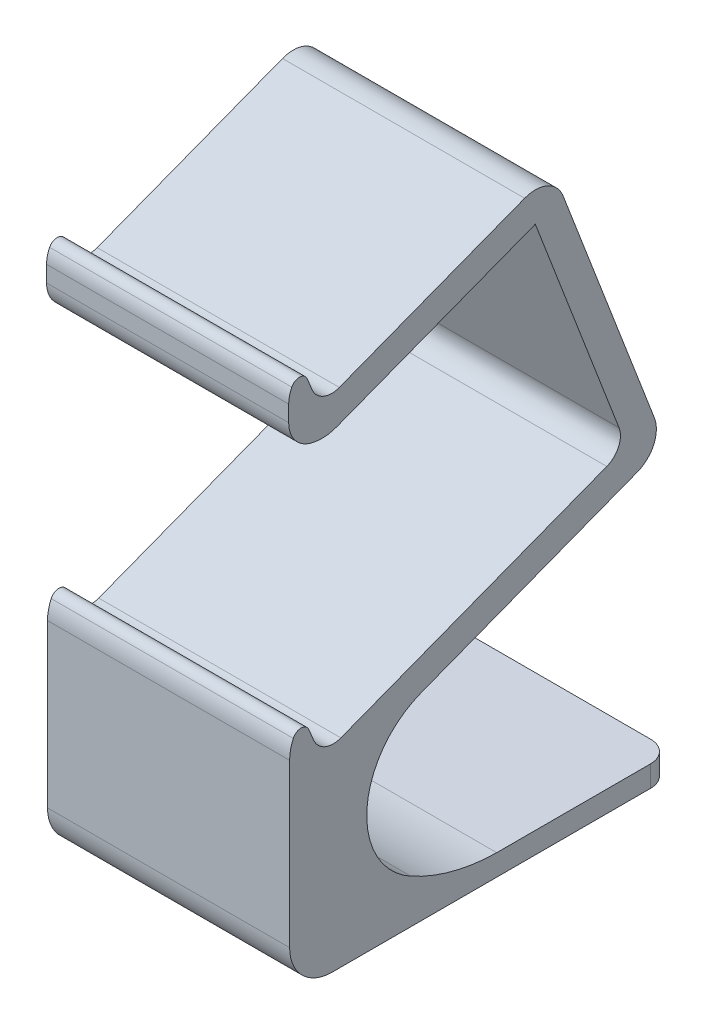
ISO-10303-21;
HEADER;
FILE_DESCRIPTION(('STEP AP214'),'2;1');
FILE_NAME('part.step','',(''),(''),'','','');
FILE_SCHEMA(('AUTOMOTIVE_DESIGN { 1 0 10303 214 1 1 1 1 }'));
ENDSEC;
DATA;
#1=APPLICATION_CONTEXT('core data for automotive mechanical design processes');
#2=APPLICATION_PROTOCOL_DEFINITION('international standard','automotive_design',2000,#1);
#3=PRODUCT_CONTEXT('',#1,'mechanical');
#4=PRODUCT('Part','Part','',(#3));
#5=PRODUCT_RELATED_PRODUCT_CATEGORY('part','',(#4));
#6=PRODUCT_DEFINITION_FORMATION('','',#4);
#7=PRODUCT_DEFINITION_CONTEXT('part definition',#1,'design');
#8=PRODUCT_DEFINITION('design','',#6,#7);
#9=PRODUCT_DEFINITION_SHAPE('','',#8);
#10=(LENGTH_UNIT() NAMED_UNIT(*) SI_UNIT(.MILLI.,.METRE.));
#11=(NAMED_UNIT(*) PLANE_ANGLE_UNIT() SI_UNIT($,.RADIAN.));
#12=(NAMED_UNIT(*) SI_UNIT($,.STERADIAN.) SOLID_ANGLE_UNIT());
#13=UNCERTAINTY_MEASURE_WITH_UNIT(LENGTH_MEASURE(1.E-05),#10,'distance_accuracy_value','');
#14=(GEOMETRIC_REPRESENTATION_CONTEXT(3) GLOBAL_UNCERTAINTY_ASSIGNED_CONTEXT((#13)) GLOBAL_UNIT_ASSIGNED_CONTEXT((#10,
#11,#12)) REPRESENTATION_CONTEXT('',''));
#15=CARTESIAN_POINT('',(0.,0.,0.));
#16=DIRECTION('',(0.,0.,1.));
#17=DIRECTION('',(1.,0.,0.));
#18=AXIS2_PLACEMENT_3D('',#15,#16,#17);
#19=CARTESIAN_POINT('',(0.,5.,0.));
#20=DIRECTION('',(0.,-1.,0.));
#21=DIRECTION('',(0.,0.,-1.));
#22=AXIS2_PLACEMENT_3D('',#19,#20,#21);
#23=PLANE('',#22);
#24=DIRECTION('',(-1.,0.,0.));
#25=VECTOR('',#24,1.);
#26=CARTESIAN_POINT('',(0.,5.,-90.));
#27=LINE('',#26,#25);
#28=CARTESIAN_POINT('',(52.,5.,-90.));
#29=VERTEX_POINT('',#28);
#30=CARTESIAN_POINT('',(5.,5.,-90.));
#31=VERTEX_POINT('',#30);
#32=EDGE_CURVE('E253',#29,#31,#27,.T.);
#33=ORIENTED_EDGE('',*,*,#32,.T.);
#34=CARTESIAN_POINT('',(5.,5.,-85.));
#35=DIRECTION('',(0.,-1.,0.));
#36=DIRECTION('',(0.,0.,-1.));
#37=AXIS2_PLACEMENT_3D('',#34,#35,#36);
#38=CIRCLE('',#37,5.);
#39=CARTESIAN_POINT('',(0.,5.,-85.));
#40=VERTEX_POINT('',#39);
#41=EDGE_CURVE('E330',#31,#40,#38,.F.);
#42=ORIENTED_EDGE('',*,*,#41,.T.);
#43=DIRECTION('',(0.,0.,1.));
#44=VECTOR('',#43,1.);
#45=CARTESIAN_POINT('',(0.,5.,0.));
#46=LINE('',#45,#44);
#47=CARTESIAN_POINT('',(0.,5.,-48.75));
#48=VERTEX_POINT('',#47);
#49=EDGE_CURVE('E245',#40,#48,#46,.T.);
#50=ORIENTED_EDGE('',*,*,#49,.T.);
#51=DIRECTION('',(1.,0.,0.));
#52=VECTOR('',#51,1.);
#53=CARTESIAN_POINT('',(57.,5.,-48.75));
#54=LINE('',#53,#52);
#55=CARTESIAN_POINT('',(57.,5.,-48.75));
#56=VERTEX_POINT('',#55);
#57=EDGE_CURVE('E231',#48,#56,#54,.T.);
#58=ORIENTED_EDGE('',*,*,#57,.T.);
#59=DIRECTION('',(0.,0.,-1.));
#60=VECTOR('',#59,1.);
#61=CARTESIAN_POINT('',(57.,5.,0.));
#62=LINE('',#61,#60);
#63=CARTESIAN_POINT('',(57.,5.,-85.));
#64=VERTEX_POINT('',#63);
#65=EDGE_CURVE('E242',#56,#64,#62,.T.);
#66=ORIENTED_EDGE('',*,*,#65,.T.);
#67=CARTESIAN_POINT('',(52.,5.,-85.));
#68=DIRECTION('',(0.,-1.,0.));
#69=DIRECTION('',(0.,0.,-1.));
#70=AXIS2_PLACEMENT_3D('',#67,#68,#69);
#71=CIRCLE('',#70,5.);
#72=EDGE_CURVE('E328',#64,#29,#71,.F.);
#73=ORIENTED_EDGE('',*,*,#72,.T.);
#74=EDGE_LOOP('',(#33,#42,#50,#58,#66,#73));
#75=FACE_BOUND('',#74,.T.);
#76=ADVANCED_FACE('F37',(#75),#23,.F.);
#77=CARTESIAN_POINT('',(0.,5.,0.));
#78=DIRECTION('',(1.,0.,0.));
#79=DIRECTION('',(0.,0.,-1.));
#80=AXIS2_PLACEMENT_3D('',#77,#78,#79);
#81=PLANE('',#80);
#82=CARTESIAN_POINT('',(0.,120.938108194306,-6.77645214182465));
#83=DIRECTION('',(1.,0.,0.));
#84=DIRECTION('',(0.,0.,-1.));
#85=AXIS2_PLACEMENT_3D('',#82,#83,#84);
#86=CIRCLE('',#85,7.);
#87=CARTESIAN_POINT('',(0.,120.938108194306,0.223547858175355));
#88=VERTEX_POINT('',#87);
#89=CARTESIAN_POINT('',(0.,124.03637918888,-0.499453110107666));
#90=VERTEX_POINT('',#89);
#91=EDGE_CURVE('E370',#88,#90,#86,.F.);
#92=ORIENTED_EDGE('',*,*,#91,.T.);
#93=CARTESIAN_POINT('',(0.,123.151158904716,-2.29288140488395));
#94=DIRECTION('',(1.,0.,0.));
#95=DIRECTION('',(0.,0.,-1.));
#96=AXIS2_PLACEMENT_3D('',#93,#94,#95);
#97=CIRCLE('',#96,2.);
#98=CARTESIAN_POINT('',(0.,123.910071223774,-4.14330084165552));
#99=VERTEX_POINT('',#98);
#100=EDGE_CURVE('E59',#90,#99,#97,.F.);
#101=ORIENTED_EDGE('',*,*,#100,.T.);
#102=DIRECTION('',(0.,-0.925209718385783,-0.379456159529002));
#103=VECTOR('',#102,1.);
#104=CARTESIAN_POINT('',(0.,126.803907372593,-2.95645214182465));
#105=LINE('',#104,#103);
#106=CARTESIAN_POINT('',(0.,121.14907619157,-5.27566742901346));
#107=VERTEX_POINT('',#106);
#108=EDGE_CURVE('E390',#99,#107,#105,.T.);
#109=ORIENTED_EDGE('',*,*,#108,.T.);
#110=CARTESIAN_POINT('',(0.,123.046356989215,-9.90171602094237));
#111=DIRECTION('',(1.,0.,0.));
#112=DIRECTION('',(0.,0.,-1.));
#113=AXIS2_PLACEMENT_3D('',#110,#111,#112);
#114=CIRCLE('',#113,5.);
#115=CARTESIAN_POINT('',(0.,118.378454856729,-11.6935557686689));
#116=VERTEX_POINT('',#115);
#117=EDGE_CURVE('E347',#107,#116,#114,.T.);
#118=ORIENTED_EDGE('',*,*,#117,.T.);
#119=DIRECTION('',(0.,0.358367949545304,-0.933580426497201));
#120=VECTOR('',#119,1.);
#121=CARTESIAN_POINT('',(0.,135.126800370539,-55.3244875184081));
#122=LINE('',#121,#120);
#123=CARTESIAN_POINT('',(0.,135.126800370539,-55.3244875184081));
#124=VERTEX_POINT('',#123);
#125=EDGE_CURVE('E407',#116,#124,#122,.T.);
#126=ORIENTED_EDGE('',*,*,#125,.T.);
#127=CARTESIAN_POINT('',(0.,128.590007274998,-57.8337272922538));
#128=DIRECTION('',(1.,0.,0.));
#129=DIRECTION('',(0.,0.,-1.));
#130=AXIS2_PLACEMENT_3D('',#127,#128,#129);
#131=CIRCLE('',#130,7.00185319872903);
#132=CARTESIAN_POINT('',(0.,131.099247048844,-64.370520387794));
#133=VERTEX_POINT('',#132);
#134=EDGE_CURVE('E405',#124,#133,#131,.F.);
#135=ORIENTED_EDGE('',*,*,#134,.T.);
#136=DIRECTION('',(0.,-0.9335804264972,-0.358367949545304));
#137=VECTOR('',#136,1.);
#138=CARTESIAN_POINT('',(0.,75.0844214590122,-85.8725973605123));
#139=LINE('',#138,#137);
#140=CARTESIAN_POINT('',(0.,75.0844214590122,-85.8725973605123));
#141=VERTEX_POINT('',#140);
#142=EDGE_CURVE('E402',#133,#141,#139,.T.);
#143=ORIENTED_EDGE('',*,*,#142,.T.);
#144=CARTESIAN_POINT('',(0.,72.5751816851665,-79.335804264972));
#145=DIRECTION('',(1.,0.,0.));
#146=DIRECTION('',(0.,0.,-1.));
#147=AXIS2_PLACEMENT_3D('',#144,#145,#146);
#148=CIRCLE('',#147,7.00185319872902);
#149=CARTESIAN_POINT('',(0.,66.0383885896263,-81.8450440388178));
#150=VERTEX_POINT('',#149);
#151=EDGE_CURVE('E399',#141,#150,#148,.F.);
#152=ORIENTED_EDGE('',*,*,#151,.T.);
#153=DIRECTION('',(0.,-0.3583679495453,0.933580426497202));
#154=VECTOR('',#153,1.);
#155=CARTESIAN_POINT('',(0.,61.4915021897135,-70.));
#156=LINE('',#155,#154);
#157=CARTESIAN_POINT('',(0.,46.5150375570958,-30.9849757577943));
#158=VERTEX_POINT('',#157);
#159=EDGE_CURVE('E447',#150,#158,#156,.T.);
#160=ORIENTED_EDGE('',*,*,#159,.T.);
#161=CARTESIAN_POINT('',(0.,27.8434290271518,-38.1523347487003));
#162=DIRECTION('',(1.,0.,0.));
#163=DIRECTION('',(0.,0.,-1.));
#164=AXIS2_PLACEMENT_3D('',#161,#162,#163);
#165=CIRCLE('',#164,20.);
#166=CARTESIAN_POINT('',(0.,10.3110967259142,-28.5285452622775));
#167=VERTEX_POINT('',#166);
#168=EDGE_CURVE('E312',#158,#167,#165,.T.);
#169=ORIENTED_EDGE('',*,*,#168,.T.);
#170=CARTESIAN_POINT('',(0.,48.0663494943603,-49.2530329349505));
#171=DIRECTION('',(1.,0.,0.));
#172=DIRECTION('',(0.,0.,-1.));
#173=AXIS2_PLACEMENT_3D('',#170,#171,#172);
#174=CIRCLE('',#173,43.0692872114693);
#175=EDGE_CURVE('E237',#167,#48,#174,.T.);
#176=ORIENTED_EDGE('',*,*,#175,.T.);
#177=ORIENTED_EDGE('',*,*,#49,.F.);
#178=DIRECTION('',(0.,-1.,0.));
#179=VECTOR('',#178,1.);
#180=CARTESIAN_POINT('',(0.,5.,-85.));
#181=LINE('',#180,#179);
#182=CARTESIAN_POINT('',(0.,0.,-85.));
#183=VERTEX_POINT('',#182);
#184=EDGE_CURVE('E316',#40,#183,#181,.T.);
#185=ORIENTED_EDGE('',*,*,#184,.T.);
#186=DIRECTION('',(0.,0.,1.));
#187=VECTOR('',#186,1.);
#188=CARTESIAN_POINT('',(0.,0.,0.));
#189=LINE('',#188,#187);
#190=CARTESIAN_POINT('',(0.,0.,-10.));
#191=VERTEX_POINT('',#190);
#192=EDGE_CURVE('E261',#183,#191,#189,.T.);
#193=ORIENTED_EDGE('',*,*,#192,.T.);
#194=CARTESIAN_POINT('',(0.,10.,-10.));
#195=DIRECTION('',(1.,0.,0.));
#196=DIRECTION('',(0.,0.,-1.));
#197=AXIS2_PLACEMENT_3D('',#194,#195,#196);
#198=CIRCLE('',#197,10.);
#199=CARTESIAN_POINT('',(0.,10.,0.));
#200=VERTEX_POINT('',#199);
#201=EDGE_CURVE('E279',#191,#200,#198,.F.);
#202=ORIENTED_EDGE('',*,*,#201,.T.);
#203=DIRECTION('',(0.,-1.,0.));
#204=VECTOR('',#203,1.);
#205=CARTESIAN_POINT('',(0.,5.,0.));
#206=LINE('',#205,#204);
#207=CARTESIAN_POINT('',(0.,48.1958885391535,0.));
#208=VERTEX_POINT('',#207);
#209=EDGE_CURVE('E269',#208,#200,#206,.T.);
#210=ORIENTED_EDGE('',*,*,#209,.F.);
#211=CARTESIAN_POINT('',(0.,48.1958885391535,-10.));
#212=DIRECTION('',(1.,0.,0.));
#213=DIRECTION('',(0.,0.,-1.));
#214=AXIS2_PLACEMENT_3D('',#211,#212,#213);
#215=CIRCLE('',#214,10.);
#216=CARTESIAN_POINT('',(0.,52.2463152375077,-0.857022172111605));
#217=VERTEX_POINT('',#216);
#218=EDGE_CURVE('E286',#208,#217,#215,.F.);
#219=ORIENTED_EDGE('',*,*,#218,.T.);
#220=CARTESIAN_POINT('',(0.,51.4362298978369,-2.68561773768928));
#221=DIRECTION('',(1.,0.,0.));
#222=DIRECTION('',(0.,0.,-1.));
#223=AXIS2_PLACEMENT_3D('',#220,#221,#222);
#224=CIRCLE('',#223,2.);
#225=CARTESIAN_POINT('',(0.,52.1980052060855,-4.53486038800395));
#226=VERTEX_POINT('',#225);
#227=EDGE_CURVE('E296',#217,#226,#224,.F.);
#228=ORIENTED_EDGE('',*,*,#227,.T.);
#229=DIRECTION('',(0.,-0.924621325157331,-0.380887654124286));
#230=VECTOR('',#229,1.);
#231=CARTESIAN_POINT('',(0.,55.5031831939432,-3.17332842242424));
#232=LINE('',#231,#230);
#233=CARTESIAN_POINT('',(0.,49.5123927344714,-5.64116910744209));
#234=VERTEX_POINT('',#233);
#235=EDGE_CURVE('E442',#226,#234,#232,.T.);
#236=ORIENTED_EDGE('',*,*,#235,.T.);
#237=CARTESIAN_POINT('',(0.,51.4168310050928,-10.2642757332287));
#238=DIRECTION('',(1.,0.,0.));
#239=DIRECTION('',(0.,0.,-1.));
#240=AXIS2_PLACEMENT_3D('',#237,#238,#239);
#241=CIRCLE('',#240,5.);
#242=CARTESIAN_POINT('',(0.,46.7489288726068,-12.0561154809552));
#243=VERTEX_POINT('',#242);
#244=EDGE_CURVE('E303',#234,#243,#241,.T.);
#245=ORIENTED_EDGE('',*,*,#244,.T.);
#246=DIRECTION('',(0.,0.3583679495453,-0.933580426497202));
#247=VECTOR('',#246,1.);
#248=CARTESIAN_POINT('',(0.,45.,-7.5));
#249=LINE('',#248,#247);
#250=CARTESIAN_POINT('',(0.,70.78334193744,-74.667902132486));
#251=VERTEX_POINT('',#250);
#252=EDGE_CURVE('E264',#251,#243,#249,.F.);
#253=ORIENTED_EDGE('',*,*,#252,.F.);
#254=CARTESIAN_POINT('',(0.,75.451244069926,-72.8760623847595));
#255=DIRECTION('',(1.,0.,0.));
#256=DIRECTION('',(0.,0.,-1.));
#257=AXIS2_PLACEMENT_3D('',#254,#255,#256);
#258=CIRCLE('',#257,5.);
#259=CARTESIAN_POINT('',(0.,77.2430838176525,-77.5439645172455));
#260=VERTEX_POINT('',#259);
#261=EDGE_CURVE('E340',#251,#260,#258,.T.);
#262=ORIENTED_EDGE('',*,*,#261,.T.);
#263=DIRECTION('',(0.,0.933580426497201,0.358367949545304));
#264=VECTOR('',#263,1.);
#265=CARTESIAN_POINT('',(0.,128.590007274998,-57.8337272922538));
#266=LINE('',#265,#264);
#267=CARTESIAN_POINT('',(0.,128.590007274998,-57.8337272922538));
#268=VERTEX_POINT('',#267);
#269=EDGE_CURVE('E412',#260,#268,#266,.T.);
#270=ORIENTED_EDGE('',*,*,#269,.T.);
#271=DIRECTION('',(0.,-0.358367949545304,0.933580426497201));
#272=VECTOR('',#271,1.);
#273=CARTESIAN_POINT('',(0.,107.267114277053,-2.2856919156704));
#274=LINE('',#273,#272);
#275=CARTESIAN_POINT('',(0.,110.685935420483,-11.1920254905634));
#276=VERTEX_POINT('',#275);
#277=EDGE_CURVE('E409',#268,#276,#274,.T.);
#278=ORIENTED_EDGE('',*,*,#277,.T.);
#279=CARTESIAN_POINT('',(0.,120.021739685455,-7.60834599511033));
#280=DIRECTION('',(1.,0.,0.));
#281=DIRECTION('',(0.,0.,-1.));
#282=AXIS2_PLACEMENT_3D('',#279,#280,#281);
#283=CIRCLE('',#282,10.);
#284=CARTESIAN_POINT('',(0.,110.413899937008,-4.83536648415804));
#285=VERTEX_POINT('',#284);
#286=EDGE_CURVE('E355',#276,#285,#283,.F.);
#287=ORIENTED_EDGE('',*,*,#286,.T.);
#288=CARTESIAN_POINT('',(0.,117.139387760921,-6.77645214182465));
#289=DIRECTION('',(1.,0.,0.));
#290=DIRECTION('',(0.,0.,-1.));
#291=AXIS2_PLACEMENT_3D('',#288,#289,#290);
#292=CIRCLE('',#291,7.);
#293=CARTESIAN_POINT('',(0.,117.139387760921,0.223547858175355));
#294=VERTEX_POINT('',#293);
#295=EDGE_CURVE('E365',#285,#294,#292,.F.);
#296=ORIENTED_EDGE('',*,*,#295,.T.);
#297=DIRECTION('',(0.,1.,0.));
#298=VECTOR('',#297,1.);
#299=CARTESIAN_POINT('',(0.,113.803907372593,0.223547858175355));
#300=LINE('',#299,#298);
#301=EDGE_CURVE('E247',#294,#88,#300,.T.);
#302=ORIENTED_EDGE('',*,*,#301,.T.);
#303=EDGE_LOOP('',(#92,#101,#109,#118,#126,#135,#143,#152,#160,#169,#176,#177,#185,#193,#202,
#210,#219,#228,#236,#245,#253,#262,#270,#278,#287,#296,#302));
#304=FACE_BOUND('',#303,.T.);
#305=ADVANCED_FACE('F385',(#304),#81,.F.);
#306=CARTESIAN_POINT('',(0.,5.,0.));
#307=DIRECTION('',(0.,0.,-1.));
#308=DIRECTION('',(-1.,0.,0.));
#309=AXIS2_PLACEMENT_3D('',#306,#307,#308);
#310=PLANE('',#309);
#311=DIRECTION('',(0.,-1.,0.));
#312=VECTOR('',#311,1.);
#313=CARTESIAN_POINT('',(57.,5.,0.));
#314=LINE('',#313,#312);
#315=CARTESIAN_POINT('',(57.,48.1958885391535,0.));
#316=VERTEX_POINT('',#315);
#317=CARTESIAN_POINT('',(57.,10.,0.));
#318=VERTEX_POINT('',#317);
#319=EDGE_CURVE('E255',#316,#318,#314,.T.);
#320=ORIENTED_EDGE('',*,*,#319,.F.);
#321=DIRECTION('',(-1.,0.,0.));
#322=VECTOR('',#321,1.);
#323=CARTESIAN_POINT('',(0.,48.1958885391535,0.));
#324=LINE('',#323,#322);
#325=EDGE_CURVE('E284',#316,#208,#324,.T.);
#326=ORIENTED_EDGE('',*,*,#325,.T.);
#327=ORIENTED_EDGE('',*,*,#209,.T.);
#328=DIRECTION('',(1.,0.,0.));
#329=VECTOR('',#328,1.);
#330=CARTESIAN_POINT('',(57.,10.,0.));
#331=LINE('',#330,#329);
#332=EDGE_CURVE('E271',#200,#318,#331,.T.);
#333=ORIENTED_EDGE('',*,*,#332,.T.);
#334=EDGE_LOOP('',(#320,#326,#327,#333));
#335=FACE_BOUND('',#334,.T.);
#336=ADVANCED_FACE('F483',(#335),#310,.F.);
#337=CARTESIAN_POINT('',(57.,5.,0.));
#338=DIRECTION('',(-1.,0.,0.));
#339=DIRECTION('',(0.,0.,1.));
#340=AXIS2_PLACEMENT_3D('',#337,#338,#339);
#341=PLANE('',#340);
#342=DIRECTION('',(0.,0.925209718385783,0.379456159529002));
#343=VECTOR('',#342,1.);
#344=CARTESIAN_POINT('',(57.,126.803907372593,-2.95645214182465));
#345=LINE('',#344,#343);
#346=CARTESIAN_POINT('',(57.,121.14907619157,-5.27566742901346));
#347=VERTEX_POINT('',#346);
#348=CARTESIAN_POINT('',(57.,123.910071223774,-4.14330084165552));
#349=VERTEX_POINT('',#348);
#350=EDGE_CURVE('E392',#347,#349,#345,.T.);
#351=ORIENTED_EDGE('',*,*,#350,.T.);
#352=CARTESIAN_POINT('',(57.,123.151158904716,-2.29288140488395));
#353=DIRECTION('',(-1.,0.,0.));
#354=DIRECTION('',(0.,0.,1.));
#355=AXIS2_PLACEMENT_3D('',#352,#353,#354);
#356=CIRCLE('',#355,2.);
#357=CARTESIAN_POINT('',(57.,124.03637918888,-0.499453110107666));
#358=VERTEX_POINT('',#357);
#359=EDGE_CURVE('E11',#349,#358,#356,.F.);
#360=ORIENTED_EDGE('',*,*,#359,.T.);
#361=CARTESIAN_POINT('',(57.,120.938108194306,-6.77645214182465));
#362=DIRECTION('',(-1.,0.,0.));
#363=DIRECTION('',(0.,0.,1.));
#364=AXIS2_PLACEMENT_3D('',#361,#362,#363);
#365=CIRCLE('',#364,7.);
#366=CARTESIAN_POINT('',(57.,120.938108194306,0.223547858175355));
#367=VERTEX_POINT('',#366);
#368=EDGE_CURVE('E372',#358,#367,#365,.F.);
#369=ORIENTED_EDGE('',*,*,#368,.T.);
#370=DIRECTION('',(0.,-1.,0.));
#371=VECTOR('',#370,1.);
#372=CARTESIAN_POINT('',(57.,113.803907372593,0.223547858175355));
#373=LINE('',#372,#371);
#374=CARTESIAN_POINT('',(57.,117.139387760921,0.223547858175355));
#375=VERTEX_POINT('',#374);
#376=EDGE_CURVE('E396',#367,#375,#373,.T.);
#377=ORIENTED_EDGE('',*,*,#376,.T.);
#378=CARTESIAN_POINT('',(57.,117.139387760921,-6.77645214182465));
#379=DIRECTION('',(-1.,0.,0.));
#380=DIRECTION('',(0.,0.,1.));
#381=AXIS2_PLACEMENT_3D('',#378,#379,#380);
#382=CIRCLE('',#381,7.);
#383=CARTESIAN_POINT('',(57.,110.413899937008,-4.83536648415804));
#384=VERTEX_POINT('',#383);
#385=EDGE_CURVE('E361',#375,#384,#382,.F.);
#386=ORIENTED_EDGE('',*,*,#385,.T.);
#387=CARTESIAN_POINT('',(57.,120.021739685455,-7.60834599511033));
#388=DIRECTION('',(-1.,0.,0.));
#389=DIRECTION('',(0.,0.,1.));
#390=AXIS2_PLACEMENT_3D('',#387,#388,#389);
#391=CIRCLE('',#390,10.);
#392=CARTESIAN_POINT('',(57.,110.685935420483,-11.1920254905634));
#393=VERTEX_POINT('',#392);
#394=EDGE_CURVE('E351',#384,#393,#391,.F.);
#395=ORIENTED_EDGE('',*,*,#394,.T.);
#396=DIRECTION('',(0.,0.358367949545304,-0.9335804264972));
#397=VECTOR('',#396,1.);
#398=CARTESIAN_POINT('',(57.,107.267114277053,-2.2856919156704));
#399=LINE('',#398,#397);
#400=CARTESIAN_POINT('',(57.,128.590007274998,-57.8337272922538));
#401=VERTEX_POINT('',#400);
#402=EDGE_CURVE('E426',#393,#401,#399,.T.);
#403=ORIENTED_EDGE('',*,*,#402,.T.);
#404=DIRECTION('',(0.,-0.9335804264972,-0.358367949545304));
#405=VECTOR('',#404,1.);
#406=CARTESIAN_POINT('',(57.,128.590007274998,-57.8337272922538));
#407=LINE('',#406,#405);
#408=CARTESIAN_POINT('',(57.,77.2430838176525,-77.5439645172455));
#409=VERTEX_POINT('',#408);
#410=EDGE_CURVE('E428',#401,#409,#407,.T.);
#411=ORIENTED_EDGE('',*,*,#410,.T.);
#412=CARTESIAN_POINT('',(57.,75.451244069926,-72.8760623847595));
#413=DIRECTION('',(-1.,0.,0.));
#414=DIRECTION('',(0.,0.,1.));
#415=AXIS2_PLACEMENT_3D('',#412,#413,#414);
#416=CIRCLE('',#415,5.);
#417=CARTESIAN_POINT('',(57.,70.78334193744,-74.667902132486));
#418=VERTEX_POINT('',#417);
#419=EDGE_CURVE('E338',#409,#418,#416,.T.);
#420=ORIENTED_EDGE('',*,*,#419,.T.);
#421=DIRECTION('',(0.,-0.3583679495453,0.933580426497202));
#422=VECTOR('',#421,1.);
#423=CARTESIAN_POINT('',(57.,45.,-7.5));
#424=LINE('',#423,#422);
#425=CARTESIAN_POINT('',(57.,46.7489288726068,-12.0561154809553));
#426=VERTEX_POINT('',#425);
#427=EDGE_CURVE('E450',#426,#418,#424,.F.);
#428=ORIENTED_EDGE('',*,*,#427,.F.);
#429=CARTESIAN_POINT('',(57.,51.4168310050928,-10.2642757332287));
#430=DIRECTION('',(-1.,0.,0.));
#431=DIRECTION('',(0.,0.,1.));
#432=AXIS2_PLACEMENT_3D('',#429,#430,#431);
#433=CIRCLE('',#432,5.);
#434=CARTESIAN_POINT('',(57.,49.5123927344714,-5.64116910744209));
#435=VERTEX_POINT('',#434);
#436=EDGE_CURVE('E306',#426,#435,#433,.T.);
#437=ORIENTED_EDGE('',*,*,#436,.T.);
#438=DIRECTION('',(0.,0.924621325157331,0.380887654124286));
#439=VECTOR('',#438,1.);
#440=CARTESIAN_POINT('',(57.,55.5031831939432,-3.17332842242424));
#441=LINE('',#440,#439);
#442=CARTESIAN_POINT('',(57.,52.1980052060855,-4.53486038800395));
#443=VERTEX_POINT('',#442);
#444=EDGE_CURVE('E414',#435,#443,#441,.T.);
#445=ORIENTED_EDGE('',*,*,#444,.T.);
#446=CARTESIAN_POINT('',(57.,51.4362298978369,-2.68561773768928));
#447=DIRECTION('',(-1.,0.,0.));
#448=DIRECTION('',(0.,0.,1.));
#449=AXIS2_PLACEMENT_3D('',#446,#447,#448);
#450=CIRCLE('',#449,2.);
#451=CARTESIAN_POINT('',(57.,52.2463152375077,-0.857022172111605));
#452=VERTEX_POINT('',#451);
#453=EDGE_CURVE('E292',#443,#452,#450,.F.);
#454=ORIENTED_EDGE('',*,*,#453,.T.);
#455=CARTESIAN_POINT('',(57.,48.1958885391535,-10.));
#456=DIRECTION('',(-1.,0.,0.));
#457=DIRECTION('',(0.,0.,1.));
#458=AXIS2_PLACEMENT_3D('',#455,#456,#457);
#459=CIRCLE('',#458,10.);
#460=EDGE_CURVE('E282',#452,#316,#459,.F.);
#461=ORIENTED_EDGE('',*,*,#460,.T.);
#462=ORIENTED_EDGE('',*,*,#319,.T.);
#463=CARTESIAN_POINT('',(57.,10.,-10.));
#464=DIRECTION('',(-1.,0.,0.));
#465=DIRECTION('',(0.,0.,1.));
#466=AXIS2_PLACEMENT_3D('',#463,#464,#465);
#467=CIRCLE('',#466,10.);
#468=CARTESIAN_POINT('',(57.,0.,-10.));
#469=VERTEX_POINT('',#468);
#470=EDGE_CURVE('E274',#318,#469,#467,.F.);
#471=ORIENTED_EDGE('',*,*,#470,.T.);
#472=DIRECTION('',(0.,0.,-1.));
#473=VECTOR('',#472,1.);
#474=CARTESIAN_POINT('',(57.,0.,0.));
#475=LINE('',#474,#473);
#476=CARTESIAN_POINT('',(57.,0.,-85.));
#477=VERTEX_POINT('',#476);
#478=EDGE_CURVE('E263',#469,#477,#475,.T.);
#479=ORIENTED_EDGE('',*,*,#478,.T.);
#480=DIRECTION('',(0.,-1.,0.));
#481=VECTOR('',#480,1.);
#482=CARTESIAN_POINT('',(57.,5.,-85.));
#483=LINE('',#482,#481);
#484=EDGE_CURVE('E252',#477,#64,#483,.F.);
#485=ORIENTED_EDGE('',*,*,#484,.T.);
#486=ORIENTED_EDGE('',*,*,#65,.F.);
#487=CARTESIAN_POINT('',(57.,48.0663494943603,-49.2530329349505));
#488=DIRECTION('',(1.,0.,0.));
#489=DIRECTION('',(0.,0.,-1.));
#490=AXIS2_PLACEMENT_3D('',#487,#488,#489);
#491=CIRCLE('',#490,43.0692872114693);
#492=CARTESIAN_POINT('',(57.,10.3110967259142,-28.5285452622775));
#493=VERTEX_POINT('',#492);
#494=EDGE_CURVE('E227',#493,#56,#491,.T.);
#495=ORIENTED_EDGE('',*,*,#494,.F.);
#496=CARTESIAN_POINT('',(57.,27.8434290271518,-38.1523347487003));
#497=DIRECTION('',(-1.,0.,0.));
#498=DIRECTION('',(0.,0.,1.));
#499=AXIS2_PLACEMENT_3D('',#496,#497,#498);
#500=CIRCLE('',#499,20.);
#501=CARTESIAN_POINT('',(57.,46.5150375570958,-30.9849757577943));
#502=VERTEX_POINT('',#501);
#503=EDGE_CURVE('E314',#493,#502,#500,.T.);
#504=ORIENTED_EDGE('',*,*,#503,.T.);
#505=DIRECTION('',(0.,-0.3583679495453,0.933580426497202));
#506=VECTOR('',#505,1.);
#507=CARTESIAN_POINT('',(57.,61.4915021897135,-70.));
#508=LINE('',#507,#506);
#509=CARTESIAN_POINT('',(57.,66.0383885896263,-81.8450440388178));
#510=VERTEX_POINT('',#509);
#511=EDGE_CURVE('E445',#510,#502,#508,.T.);
#512=ORIENTED_EDGE('',*,*,#511,.F.);
#513=CARTESIAN_POINT('',(57.,72.5751816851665,-79.335804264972));
#514=DIRECTION('',(1.,0.,0.));
#515=DIRECTION('',(0.,0.,-1.));
#516=AXIS2_PLACEMENT_3D('',#513,#514,#515);
#517=CIRCLE('',#516,7.00185319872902);
#518=CARTESIAN_POINT('',(57.,75.0844214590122,-85.8725973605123));
#519=VERTEX_POINT('',#518);
#520=EDGE_CURVE('E398',#510,#519,#517,.T.);
#521=ORIENTED_EDGE('',*,*,#520,.T.);
#522=DIRECTION('',(0.,0.9335804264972,0.358367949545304));
#523=VECTOR('',#522,1.);
#524=CARTESIAN_POINT('',(57.,75.0844214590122,-85.8725973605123));
#525=LINE('',#524,#523);
#526=CARTESIAN_POINT('',(57.,131.099247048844,-64.370520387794));
#527=VERTEX_POINT('',#526);
#528=EDGE_CURVE('E417',#519,#527,#525,.T.);
#529=ORIENTED_EDGE('',*,*,#528,.T.);
#530=CARTESIAN_POINT('',(57.,128.590007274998,-57.8337272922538));
#531=DIRECTION('',(1.,0.,0.));
#532=DIRECTION('',(0.,0.,-1.));
#533=AXIS2_PLACEMENT_3D('',#530,#531,#532);
#534=CIRCLE('',#533,7.00185319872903);
#535=CARTESIAN_POINT('',(57.,135.126800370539,-55.3244875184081));
#536=VERTEX_POINT('',#535);
#537=EDGE_CURVE('E420',#527,#536,#534,.T.);
#538=ORIENTED_EDGE('',*,*,#537,.T.);
#539=DIRECTION('',(0.,-0.358367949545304,0.9335804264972));
#540=VECTOR('',#539,1.);
#541=CARTESIAN_POINT('',(57.,135.126800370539,-55.3244875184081));
#542=LINE('',#541,#540);
#543=CARTESIAN_POINT('',(57.,118.378454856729,-11.6935557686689));
#544=VERTEX_POINT('',#543);
#545=EDGE_CURVE('E423',#536,#544,#542,.T.);
#546=ORIENTED_EDGE('',*,*,#545,.T.);
#547=CARTESIAN_POINT('',(57.,123.046356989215,-9.90171602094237));
#548=DIRECTION('',(-1.,0.,0.));
#549=DIRECTION('',(0.,0.,1.));
#550=AXIS2_PLACEMENT_3D('',#547,#548,#549);
#551=CIRCLE('',#550,5.);
#552=EDGE_CURVE('E349',#544,#347,#551,.T.);
#553=ORIENTED_EDGE('',*,*,#552,.T.);
#554=EDGE_LOOP('',(#351,#360,#369,#377,#386,#395,#403,#411,#420,#428,#437,#445,#454,#461,#462,
#471,#479,#485,#486,#495,#504,#512,#521,#529,#538,#546,#553));
#555=FACE_BOUND('',#554,.T.);
#556=ADVANCED_FACE('F249',(#555),#341,.F.);
#557=CARTESIAN_POINT('',(0.,5.,-90.));
#558=DIRECTION('',(0.,0.,1.));
#559=DIRECTION('',(1.,0.,0.));
#560=AXIS2_PLACEMENT_3D('',#557,#558,#559);
#561=PLANE('',#560);
#562=DIRECTION('',(-1.,0.,0.));
#563=VECTOR('',#562,1.);
#564=CARTESIAN_POINT('',(0.,0.,-90.));
#565=LINE('',#564,#563);
#566=CARTESIAN_POINT('',(52.,0.,-90.));
#567=VERTEX_POINT('',#566);
#568=CARTESIAN_POINT('',(5.,0.,-90.));
#569=VERTEX_POINT('',#568);
#570=EDGE_CURVE('E257',#567,#569,#565,.T.);
#571=ORIENTED_EDGE('',*,*,#570,.T.);
#572=DIRECTION('',(0.,-1.,0.));
#573=VECTOR('',#572,1.);
#574=CARTESIAN_POINT('',(5.,5.,-90.));
#575=LINE('',#574,#573);
#576=EDGE_CURVE('E326',#569,#31,#575,.F.);
#577=ORIENTED_EDGE('',*,*,#576,.T.);
#578=ORIENTED_EDGE('',*,*,#32,.F.);
#579=DIRECTION('',(0.,-1.,0.));
#580=VECTOR('',#579,1.);
#581=CARTESIAN_POINT('',(52.,5.,-90.));
#582=LINE('',#581,#580);
#583=EDGE_CURVE('E323',#29,#567,#582,.T.);
#584=ORIENTED_EDGE('',*,*,#583,.T.);
#585=EDGE_LOOP('',(#571,#577,#578,#584));
#586=FACE_BOUND('',#585,.T.);
#587=ADVANCED_FACE('F500',(#586),#561,.F.);
#588=CARTESIAN_POINT('',(0.,0.,0.));
#589=DIRECTION('',(0.,-1.,0.));
#590=DIRECTION('',(0.,0.,-1.));
#591=AXIS2_PLACEMENT_3D('',#588,#589,#590);
#592=PLANE('',#591);
#593=ORIENTED_EDGE('',*,*,#192,.F.);
#594=CARTESIAN_POINT('',(5.,0.,-85.));
#595=DIRECTION('',(0.,-1.,0.));
#596=DIRECTION('',(0.,0.,-1.));
#597=AXIS2_PLACEMENT_3D('',#594,#595,#596);
#598=CIRCLE('',#597,5.);
#599=EDGE_CURVE('E321',#183,#569,#598,.T.);
#600=ORIENTED_EDGE('',*,*,#599,.T.);
#601=ORIENTED_EDGE('',*,*,#570,.F.);
#602=CARTESIAN_POINT('',(52.,0.,-85.));
#603=DIRECTION('',(0.,-1.,0.));
#604=DIRECTION('',(0.,0.,-1.));
#605=AXIS2_PLACEMENT_3D('',#602,#603,#604);
#606=CIRCLE('',#605,5.);
#607=EDGE_CURVE('E319',#567,#477,#606,.T.);
#608=ORIENTED_EDGE('',*,*,#607,.T.);
#609=ORIENTED_EDGE('',*,*,#478,.F.);
#610=DIRECTION('',(1.,0.,0.));
#611=VECTOR('',#610,1.);
#612=CARTESIAN_POINT('',(0.,0.,-10.));
#613=LINE('',#612,#611);
#614=EDGE_CURVE('E276',#469,#191,#613,.F.);
#615=ORIENTED_EDGE('',*,*,#614,.T.);
#616=EDGE_LOOP('',(#593,#600,#601,#608,#609,#615));
#617=FACE_BOUND('',#616,.T.);
#618=ADVANCED_FACE('F493',(#617),#592,.T.);
#619=CARTESIAN_POINT('',(0.,45.,-7.5));
#620=DIRECTION('',(0.,0.933580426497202,0.3583679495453));
#621=DIRECTION('',(0.,-0.3583679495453,0.933580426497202));
#622=AXIS2_PLACEMENT_3D('',#619,#620,#621);
#623=PLANE('',#622);
#624=ORIENTED_EDGE('',*,*,#427,.T.);
#625=DIRECTION('',(1.,0.,0.));
#626=VECTOR('',#625,1.);
#627=CARTESIAN_POINT('',(0.,70.78334193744,-74.667902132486));
#628=LINE('',#627,#626);
#629=EDGE_CURVE('E336',#418,#251,#628,.F.);
#630=ORIENTED_EDGE('',*,*,#629,.T.);
#631=ORIENTED_EDGE('',*,*,#252,.T.);
#632=DIRECTION('',(-1.,0.,0.));
#633=VECTOR('',#632,1.);
#634=CARTESIAN_POINT('',(0.,46.7489288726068,-12.0561154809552));
#635=LINE('',#634,#633);
#636=EDGE_CURVE('E301',#243,#426,#635,.F.);
#637=ORIENTED_EDGE('',*,*,#636,.T.);
#638=EDGE_LOOP('',(#624,#630,#631,#637));
#639=FACE_BOUND('',#638,.T.);
#640=ADVANCED_FACE('F456',(#639),#623,.T.);
#641=CARTESIAN_POINT('',(0.,61.4915021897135,-70.));
#642=DIRECTION('',(0.,0.933580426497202,0.3583679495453));
#643=DIRECTION('',(0.,-0.3583679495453,0.933580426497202));
#644=AXIS2_PLACEMENT_3D('',#641,#642,#643);
#645=PLANE('',#644);
#646=ORIENTED_EDGE('',*,*,#511,.T.);
#647=DIRECTION('',(1.,0.,0.));
#648=VECTOR('',#647,1.);
#649=CARTESIAN_POINT('',(0.,46.5150375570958,-30.9849757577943));
#650=LINE('',#649,#648);
#651=EDGE_CURVE('E308',#502,#158,#650,.F.);
#652=ORIENTED_EDGE('',*,*,#651,.T.);
#653=ORIENTED_EDGE('',*,*,#159,.F.);
#654=DIRECTION('',(1.,0.,0.));
#655=VECTOR('',#654,1.);
#656=CARTESIAN_POINT('',(-113.946063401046,66.0383885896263,-81.8450440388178));
#657=LINE('',#656,#655);
#658=EDGE_CURVE('E431',#150,#510,#657,.T.);
#659=ORIENTED_EDGE('',*,*,#658,.T.);
#660=EDGE_LOOP('',(#646,#652,#653,#659));
#661=FACE_BOUND('',#660,.T.);
#662=ADVANCED_FACE('F511',(#661),#645,.F.);
#663=CARTESIAN_POINT('',(0.,10.,-10.));
#664=DIRECTION('',(-1.,0.,0.));
#665=DIRECTION('',(0.,0.,1.));
#666=AXIS2_PLACEMENT_3D('',#663,#664,#665);
#667=CYLINDRICAL_SURFACE('',#666,10.);
#668=ORIENTED_EDGE('',*,*,#201,.F.);
#669=ORIENTED_EDGE('',*,*,#614,.F.);
#670=ORIENTED_EDGE('',*,*,#470,.F.);
#671=ORIENTED_EDGE('',*,*,#332,.F.);
#672=EDGE_LOOP('',(#668,#669,#670,#671));
#673=FACE_BOUND('',#672,.T.);
#674=ADVANCED_FACE('F490',(#673),#667,.T.);
#675=CARTESIAN_POINT('',(-12.9060783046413,55.5031831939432,-3.17332842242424));
#676=DIRECTION('',(0.,0.380887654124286,-0.924621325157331));
#677=DIRECTION('',(0.,0.924621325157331,0.380887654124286));
#678=AXIS2_PLACEMENT_3D('',#675,#676,#677);
#679=PLANE('',#678);
#680=ORIENTED_EDGE('',*,*,#444,.F.);
#681=DIRECTION('',(1.,0.,0.));
#682=VECTOR('',#681,1.);
#683=CARTESIAN_POINT('',(-12.9060783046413,49.5123927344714,-5.64116910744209));
#684=LINE('',#683,#682);
#685=EDGE_CURVE('E298',#435,#234,#684,.F.);
#686=ORIENTED_EDGE('',*,*,#685,.T.);
#687=ORIENTED_EDGE('',*,*,#235,.F.);
#688=DIRECTION('',(-1.,0.,0.));
#689=VECTOR('',#688,1.);
#690=CARTESIAN_POINT('',(-12.9060783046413,52.1980052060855,-4.53486038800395));
#691=LINE('',#690,#689);
#692=EDGE_CURVE('E289',#226,#443,#691,.F.);
#693=ORIENTED_EDGE('',*,*,#692,.T.);
#694=EDGE_LOOP('',(#680,#686,#687,#693));
#695=FACE_BOUND('',#694,.T.);
#696=ADVANCED_FACE('F469',(#695),#679,.T.);
#697=CARTESIAN_POINT('',(-12.9060783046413,48.1958885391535,-10.));
#698=DIRECTION('',(-1.,0.,0.));
#699=DIRECTION('',(0.,0.,1.));
#700=AXIS2_PLACEMENT_3D('',#697,#698,#699);
#701=CYLINDRICAL_SURFACE('',#700,10.);
#702=ORIENTED_EDGE('',*,*,#460,.F.);
#703=DIRECTION('',(-1.,0.,0.));
#704=VECTOR('',#703,1.);
#705=CARTESIAN_POINT('',(-12.9060783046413,52.2463152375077,-0.857022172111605));
#706=LINE('',#705,#704);
#707=EDGE_CURVE('E294',#452,#217,#706,.T.);
#708=ORIENTED_EDGE('',*,*,#707,.T.);
#709=ORIENTED_EDGE('',*,*,#218,.F.);
#710=ORIENTED_EDGE('',*,*,#325,.F.);
#711=EDGE_LOOP('',(#702,#708,#709,#710));
#712=FACE_BOUND('',#711,.T.);
#713=ADVANCED_FACE('F479',(#712),#701,.T.);
#714=CARTESIAN_POINT('',(-12.9060783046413,51.4362298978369,-2.68561773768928));
#715=DIRECTION('',(-1.,0.,0.));
#716=DIRECTION('',(0.,0.,1.));
#717=AXIS2_PLACEMENT_3D('',#714,#715,#716);
#718=CYLINDRICAL_SURFACE('',#717,2.);
#719=ORIENTED_EDGE('',*,*,#692,.F.);
#720=ORIENTED_EDGE('',*,*,#227,.F.);
#721=ORIENTED_EDGE('',*,*,#707,.F.);
#722=ORIENTED_EDGE('',*,*,#453,.F.);
#723=EDGE_LOOP('',(#719,#720,#721,#722));
#724=FACE_BOUND('',#723,.T.);
#725=ADVANCED_FACE('F473',(#724),#718,.T.);
#726=CARTESIAN_POINT('',(-12.9060783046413,51.4168310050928,-10.2642757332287));
#727=DIRECTION('',(1.,0.,0.));
#728=DIRECTION('',(0.,1.,0.));
#729=AXIS2_PLACEMENT_3D('',#726,#727,#728);
#730=CYLINDRICAL_SURFACE('',#729,5.);
#731=ORIENTED_EDGE('',*,*,#436,.F.);
#732=ORIENTED_EDGE('',*,*,#636,.F.);
#733=ORIENTED_EDGE('',*,*,#244,.F.);
#734=ORIENTED_EDGE('',*,*,#685,.F.);
#735=EDGE_LOOP('',(#731,#732,#733,#734));
#736=FACE_BOUND('',#735,.T.);
#737=ADVANCED_FACE('F465',(#736),#730,.F.);
#738=CARTESIAN_POINT('',(-113.946063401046,128.590007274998,-57.8337272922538));
#739=DIRECTION('',(0.,-0.358367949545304,0.9335804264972));
#740=DIRECTION('',(0.,-0.933580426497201,-0.358367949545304));
#741=AXIS2_PLACEMENT_3D('',#738,#739,#740);
#742=PLANE('',#741);
#743=ORIENTED_EDGE('',*,*,#269,.F.);
#744=DIRECTION('',(-1.,0.,0.));
#745=VECTOR('',#744,1.);
#746=CARTESIAN_POINT('',(-113.946063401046,77.2430838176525,-77.5439645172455));
#747=LINE('',#746,#745);
#748=EDGE_CURVE('E333',#260,#409,#747,.F.);
#749=ORIENTED_EDGE('',*,*,#748,.T.);
#750=ORIENTED_EDGE('',*,*,#410,.F.);
#751=DIRECTION('',(1.,0.,0.));
#752=VECTOR('',#751,1.);
#753=CARTESIAN_POINT('',(-113.946063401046,128.590007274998,-57.8337272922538));
#754=LINE('',#753,#752);
#755=EDGE_CURVE('E403',#268,#401,#754,.T.);
#756=ORIENTED_EDGE('',*,*,#755,.F.);
#757=EDGE_LOOP('',(#743,#749,#750,#756));
#758=FACE_BOUND('',#757,.T.);
#759=ADVANCED_FACE('F569',(#758),#742,.T.);
#760=CARTESIAN_POINT('',(-113.946063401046,107.267114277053,-2.2856919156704));
#761=DIRECTION('',(0.,-0.9335804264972,-0.358367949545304));
#762=DIRECTION('',(0.,0.358367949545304,-0.933580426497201));
#763=AXIS2_PLACEMENT_3D('',#760,#761,#762);
#764=PLANE('',#763);
#765=ORIENTED_EDGE('',*,*,#402,.F.);
#766=DIRECTION('',(1.,0.,0.));
#767=VECTOR('',#766,1.);
#768=CARTESIAN_POINT('',(0.,110.685935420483,-11.1920254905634));
#769=LINE('',#768,#767);
#770=EDGE_CURVE('E353',#393,#276,#769,.F.);
#771=ORIENTED_EDGE('',*,*,#770,.T.);
#772=ORIENTED_EDGE('',*,*,#277,.F.);
#773=ORIENTED_EDGE('',*,*,#755,.T.);
#774=EDGE_LOOP('',(#765,#771,#772,#773));
#775=FACE_BOUND('',#774,.T.);
#776=ADVANCED_FACE('F600',(#775),#764,.T.);
#777=CARTESIAN_POINT('',(-113.946063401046,135.126800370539,-55.3244875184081));
#778=DIRECTION('',(0.,0.9335804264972,0.358367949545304));
#779=DIRECTION('',(0.,-0.358367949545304,0.933580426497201));
#780=AXIS2_PLACEMENT_3D('',#777,#778,#779);
#781=PLANE('',#780);
#782=ORIENTED_EDGE('',*,*,#125,.F.);
#783=DIRECTION('',(-1.,0.,0.));
#784=VECTOR('',#783,1.);
#785=CARTESIAN_POINT('',(57.,118.378454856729,-11.6935557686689));
#786=LINE('',#785,#784);
#787=EDGE_CURVE('E345',#116,#544,#786,.F.);
#788=ORIENTED_EDGE('',*,*,#787,.T.);
#789=ORIENTED_EDGE('',*,*,#545,.F.);
#790=DIRECTION('',(1.,0.,0.));
#791=VECTOR('',#790,1.);
#792=CARTESIAN_POINT('',(-113.946063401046,135.126800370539,-55.3244875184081));
#793=LINE('',#792,#791);
#794=EDGE_CURVE('E434',#124,#536,#793,.T.);
#795=ORIENTED_EDGE('',*,*,#794,.F.);
#796=EDGE_LOOP('',(#782,#788,#789,#795));
#797=FACE_BOUND('',#796,.T.);
#798=ADVANCED_FACE('F531',(#797),#781,.T.);
#799=CARTESIAN_POINT('',(-113.946063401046,128.590007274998,-57.8337272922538));
#800=DIRECTION('',(1.,0.,0.));
#801=DIRECTION('',(0.,0.,-1.));
#802=AXIS2_PLACEMENT_3D('',#799,#800,#801);
#803=CYLINDRICAL_SURFACE('',#802,7.00185319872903);
#804=ORIENTED_EDGE('',*,*,#134,.F.);
#805=ORIENTED_EDGE('',*,*,#794,.T.);
#806=ORIENTED_EDGE('',*,*,#537,.F.);
#807=DIRECTION('',(1.,0.,0.));
#808=VECTOR('',#807,1.);
#809=CARTESIAN_POINT('',(-113.946063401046,131.099247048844,-64.370520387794));
#810=LINE('',#809,#808);
#811=EDGE_CURVE('E436',#133,#527,#810,.T.);
#812=ORIENTED_EDGE('',*,*,#811,.F.);
#813=EDGE_LOOP('',(#804,#805,#806,#812));
#814=FACE_BOUND('',#813,.T.);
#815=ADVANCED_FACE('F526',(#814),#803,.T.);
#816=CARTESIAN_POINT('',(-113.946063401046,75.0844214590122,-85.8725973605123));
#817=DIRECTION('',(0.,0.358367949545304,-0.9335804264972));
#818=DIRECTION('',(0.,0.9335804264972,0.358367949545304));
#819=AXIS2_PLACEMENT_3D('',#816,#817,#818);
#820=PLANE('',#819);
#821=ORIENTED_EDGE('',*,*,#142,.F.);
#822=ORIENTED_EDGE('',*,*,#811,.T.);
#823=ORIENTED_EDGE('',*,*,#528,.F.);
#824=DIRECTION('',(1.,0.,0.));
#825=VECTOR('',#824,1.);
#826=CARTESIAN_POINT('',(-113.946063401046,75.0844214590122,-85.8725973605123));
#827=LINE('',#826,#825);
#828=EDGE_CURVE('E438',#141,#519,#827,.T.);
#829=ORIENTED_EDGE('',*,*,#828,.F.);
#830=EDGE_LOOP('',(#821,#822,#823,#829));
#831=FACE_BOUND('',#830,.T.);
#832=ADVANCED_FACE('F522',(#831),#820,.T.);
#833=CARTESIAN_POINT('',(-113.946063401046,72.5751816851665,-79.335804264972));
#834=DIRECTION('',(1.,0.,0.));
#835=DIRECTION('',(0.,0.,-1.));
#836=AXIS2_PLACEMENT_3D('',#833,#834,#835);
#837=CYLINDRICAL_SURFACE('',#836,7.00185319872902);
#838=ORIENTED_EDGE('',*,*,#151,.F.);
#839=ORIENTED_EDGE('',*,*,#828,.T.);
#840=ORIENTED_EDGE('',*,*,#520,.F.);
#841=ORIENTED_EDGE('',*,*,#658,.F.);
#842=EDGE_LOOP('',(#838,#839,#840,#841));
#843=FACE_BOUND('',#842,.T.);
#844=ADVANCED_FACE('F516',(#843),#837,.T.);
#845=CARTESIAN_POINT('',(71.9358720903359,126.803907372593,-2.95645214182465));
#846=DIRECTION('',(0.,0.379456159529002,-0.925209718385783));
#847=DIRECTION('',(0.,0.925209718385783,0.379456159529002));
#848=AXIS2_PLACEMENT_3D('',#845,#846,#847);
#849=PLANE('',#848);
#850=ORIENTED_EDGE('',*,*,#108,.F.);
#851=DIRECTION('',(-1.,0.,0.));
#852=VECTOR('',#851,1.);
#853=CARTESIAN_POINT('',(71.9358720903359,123.910071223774,-4.14330084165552));
#854=LINE('',#853,#852);
#855=EDGE_CURVE('E45',#99,#349,#854,.F.);
#856=ORIENTED_EDGE('',*,*,#855,.T.);
#857=ORIENTED_EDGE('',*,*,#350,.F.);
#858=DIRECTION('',(-1.,0.,0.));
#859=VECTOR('',#858,1.);
#860=CARTESIAN_POINT('',(0.,121.14907619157,-5.27566742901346));
#861=LINE('',#860,#859);
#862=EDGE_CURVE('E342',#347,#107,#861,.T.);
#863=ORIENTED_EDGE('',*,*,#862,.T.);
#864=EDGE_LOOP('',(#850,#856,#857,#863));
#865=FACE_BOUND('',#864,.T.);
#866=ADVANCED_FACE('F538',(#865),#849,.T.);
#867=CARTESIAN_POINT('',(71.9358720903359,113.803907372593,0.223547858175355));
#868=DIRECTION('',(0.,0.,1.));
#869=DIRECTION('',(1.,0.,0.));
#870=AXIS2_PLACEMENT_3D('',#867,#868,#869);
#871=PLANE('',#870);
#872=ORIENTED_EDGE('',*,*,#376,.F.);
#873=DIRECTION('',(1.,0.,0.));
#874=VECTOR('',#873,1.);
#875=CARTESIAN_POINT('',(0.,120.938108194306,0.223547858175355));
#876=LINE('',#875,#874);
#877=EDGE_CURVE('E367',#367,#88,#876,.F.);
#878=ORIENTED_EDGE('',*,*,#877,.T.);
#879=ORIENTED_EDGE('',*,*,#301,.F.);
#880=DIRECTION('',(-1.,0.,0.));
#881=VECTOR('',#880,1.);
#882=CARTESIAN_POINT('',(71.9358720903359,117.139387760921,0.223547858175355));
#883=LINE('',#882,#881);
#884=EDGE_CURVE('E358',#294,#375,#883,.F.);
#885=ORIENTED_EDGE('',*,*,#884,.T.);
#886=EDGE_LOOP('',(#872,#878,#879,#885));
#887=FACE_BOUND('',#886,.T.);
#888=ADVANCED_FACE('F593',(#887),#871,.T.);
#889=CARTESIAN_POINT('',(57.,48.0663494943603,-49.2530329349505));
#890=DIRECTION('',(1.,0.,0.));
#891=DIRECTION('',(0.,0.,-1.));
#892=AXIS2_PLACEMENT_3D('',#889,#890,#891);
#893=CYLINDRICAL_SURFACE('',#892,43.0692872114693);
#894=ORIENTED_EDGE('',*,*,#175,.F.);
#895=DIRECTION('',(1.,0.,0.));
#896=VECTOR('',#895,1.);
#897=CARTESIAN_POINT('',(57.,10.3110967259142,-28.5285452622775));
#898=LINE('',#897,#896);
#899=EDGE_CURVE('E233',#167,#493,#898,.T.);
#900=ORIENTED_EDGE('',*,*,#899,.T.);
#901=ORIENTED_EDGE('',*,*,#494,.T.);
#902=ORIENTED_EDGE('',*,*,#57,.F.);
#903=EDGE_LOOP('',(#894,#900,#901,#902));
#904=FACE_BOUND('',#903,.T.);
#905=ADVANCED_FACE('F230',(#904),#893,.F.);
#906=CARTESIAN_POINT('',(57.,27.8434290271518,-38.1523347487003));
#907=DIRECTION('',(1.,0.,0.));
#908=DIRECTION('',(0.,0.,-1.));
#909=AXIS2_PLACEMENT_3D('',#906,#907,#908);
#910=CYLINDRICAL_SURFACE('',#909,20.);
#911=ORIENTED_EDGE('',*,*,#503,.F.);
#912=ORIENTED_EDGE('',*,*,#899,.F.);
#913=ORIENTED_EDGE('',*,*,#168,.F.);
#914=ORIENTED_EDGE('',*,*,#651,.F.);
#915=EDGE_LOOP('',(#911,#912,#913,#914));
#916=FACE_BOUND('',#915,.T.);
#917=ADVANCED_FACE('F508',(#916),#910,.F.);
#918=CARTESIAN_POINT('',(5.,5.,-85.));
#919=DIRECTION('',(0.,-1.,0.));
#920=DIRECTION('',(0.,0.,-1.));
#921=AXIS2_PLACEMENT_3D('',#918,#919,#920);
#922=CYLINDRICAL_SURFACE('',#921,5.);
#923=ORIENTED_EDGE('',*,*,#41,.F.);
#924=ORIENTED_EDGE('',*,*,#576,.F.);
#925=ORIENTED_EDGE('',*,*,#599,.F.);
#926=ORIENTED_EDGE('',*,*,#184,.F.);
#927=EDGE_LOOP('',(#923,#924,#925,#926));
#928=FACE_BOUND('',#927,.T.);
#929=ADVANCED_FACE('F505',(#928),#922,.T.);
#930=CARTESIAN_POINT('',(52.,5.,-85.));
#931=DIRECTION('',(0.,-1.,0.));
#932=DIRECTION('',(0.,0.,-1.));
#933=AXIS2_PLACEMENT_3D('',#930,#931,#932);
#934=CYLINDRICAL_SURFACE('',#933,5.);
#935=ORIENTED_EDGE('',*,*,#72,.F.);
#936=ORIENTED_EDGE('',*,*,#484,.F.);
#937=ORIENTED_EDGE('',*,*,#607,.F.);
#938=ORIENTED_EDGE('',*,*,#583,.F.);
#939=EDGE_LOOP('',(#935,#936,#937,#938));
#940=FACE_BOUND('',#939,.T.);
#941=ADVANCED_FACE('F497',(#940),#934,.T.);
#942=CARTESIAN_POINT('',(-113.946063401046,75.451244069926,-72.8760623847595));
#943=DIRECTION('',(-1.,0.,0.));
#944=DIRECTION('',(0.,-1.,0.));
#945=AXIS2_PLACEMENT_3D('',#942,#943,#944);
#946=CYLINDRICAL_SURFACE('',#945,5.);
#947=ORIENTED_EDGE('',*,*,#261,.F.);
#948=ORIENTED_EDGE('',*,*,#629,.F.);
#949=ORIENTED_EDGE('',*,*,#419,.F.);
#950=ORIENTED_EDGE('',*,*,#748,.F.);
#951=EDGE_LOOP('',(#947,#948,#949,#950));
#952=FACE_BOUND('',#951,.T.);
#953=ADVANCED_FACE('F576',(#952),#946,.F.);
#954=CARTESIAN_POINT('',(71.9358720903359,123.046356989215,-9.90171602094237));
#955=DIRECTION('',(1.,0.,0.));
#956=DIRECTION('',(0.,0.,-1.));
#957=AXIS2_PLACEMENT_3D('',#954,#955,#956);
#958=CYLINDRICAL_SURFACE('',#957,5.);
#959=ORIENTED_EDGE('',*,*,#552,.F.);
#960=ORIENTED_EDGE('',*,*,#787,.F.);
#961=ORIENTED_EDGE('',*,*,#117,.F.);
#962=ORIENTED_EDGE('',*,*,#862,.F.);
#963=EDGE_LOOP('',(#959,#960,#961,#962));
#964=FACE_BOUND('',#963,.T.);
#965=ADVANCED_FACE('F536',(#964),#958,.F.);
#966=CARTESIAN_POINT('',(-113.946063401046,120.021739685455,-7.60834599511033));
#967=DIRECTION('',(-1.,0.,0.));
#968=DIRECTION('',(0.,0.,1.));
#969=AXIS2_PLACEMENT_3D('',#966,#967,#968);
#970=CYLINDRICAL_SURFACE('',#969,10.);
#971=ORIENTED_EDGE('',*,*,#394,.F.);
#972=DIRECTION('',(-1.,0.,0.));
#973=VECTOR('',#972,1.);
#974=CARTESIAN_POINT('',(-113.946063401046,110.413899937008,-4.83536648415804));
#975=LINE('',#974,#973);
#976=EDGE_CURVE('E363',#384,#285,#975,.T.);
#977=ORIENTED_EDGE('',*,*,#976,.T.);
#978=ORIENTED_EDGE('',*,*,#286,.F.);
#979=ORIENTED_EDGE('',*,*,#770,.F.);
#980=EDGE_LOOP('',(#971,#977,#978,#979));
#981=FACE_BOUND('',#980,.T.);
#982=ADVANCED_FACE('F582',(#981),#970,.T.);
#983=CARTESIAN_POINT('',(-113.946063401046,117.139387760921,-6.77645214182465));
#984=DIRECTION('',(-1.,0.,0.));
#985=DIRECTION('',(0.,0.,1.));
#986=AXIS2_PLACEMENT_3D('',#983,#984,#985);
#987=CYLINDRICAL_SURFACE('',#986,7.);
#988=ORIENTED_EDGE('',*,*,#295,.F.);
#989=ORIENTED_EDGE('',*,*,#976,.F.);
#990=ORIENTED_EDGE('',*,*,#385,.F.);
#991=ORIENTED_EDGE('',*,*,#884,.F.);
#992=EDGE_LOOP('',(#988,#989,#990,#991));
#993=FACE_BOUND('',#992,.T.);
#994=ADVANCED_FACE('F543',(#993),#987,.T.);
#995=CARTESIAN_POINT('',(71.9358720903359,120.938108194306,-6.77645214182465));
#996=DIRECTION('',(-1.,0.,0.));
#997=DIRECTION('',(0.,0.,1.));
#998=AXIS2_PLACEMENT_3D('',#995,#996,#997);
#999=CYLINDRICAL_SURFACE('',#998,7.);
#1000=ORIENTED_EDGE('',*,*,#368,.F.);
#1001=DIRECTION('',(-1.,0.,0.));
#1002=VECTOR('',#1001,1.);
#1003=CARTESIAN_POINT('',(71.9358720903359,124.03637918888,-0.499453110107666));
#1004=LINE('',#1003,#1002);
#1005=EDGE_CURVE('E374',#358,#90,#1004,.T.);
#1006=ORIENTED_EDGE('',*,*,#1005,.T.);
#1007=ORIENTED_EDGE('',*,*,#91,.F.);
#1008=ORIENTED_EDGE('',*,*,#877,.F.);
#1009=EDGE_LOOP('',(#1000,#1006,#1007,#1008));
#1010=FACE_BOUND('',#1009,.T.);
#1011=ADVANCED_FACE('F380',(#1010),#999,.T.);
#1012=CARTESIAN_POINT('',(71.9358720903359,123.151158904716,-2.29288140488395));
#1013=DIRECTION('',(-1.,0.,0.));
#1014=DIRECTION('',(0.,0.,1.));
#1015=AXIS2_PLACEMENT_3D('',#1012,#1013,#1014);
#1016=CYLINDRICAL_SURFACE('',#1015,2.);
#1017=ORIENTED_EDGE('',*,*,#359,.F.);
#1018=ORIENTED_EDGE('',*,*,#855,.F.);
#1019=ORIENTED_EDGE('',*,*,#100,.F.);
#1020=ORIENTED_EDGE('',*,*,#1005,.F.);
#1021=EDGE_LOOP('',(#1017,#1018,#1019,#1020));
#1022=FACE_BOUND('',#1021,.T.);
#1023=ADVANCED_FACE('F39',(#1022),#1016,.T.);
#1024=CLOSED_SHELL('',(#76,#305,#336,#556,#587,#618,#640,#662,#674,#696,#713,#725,#737,#759,
#776,#798,#815,#832,#844,#866,#888,#905,#917,#929,#941,#953,#965,#982,#994,#1011,#1023));
#1025=MANIFOLD_SOLID_BREP('B2',#1024);
#1026=ADVANCED_BREP_SHAPE_REPRESENTATION('',(#18,#1025),#14);
#1027=SHAPE_DEFINITION_REPRESENTATION(#9,#1026);
ENDSEC;
END-ISO-10303-21;
